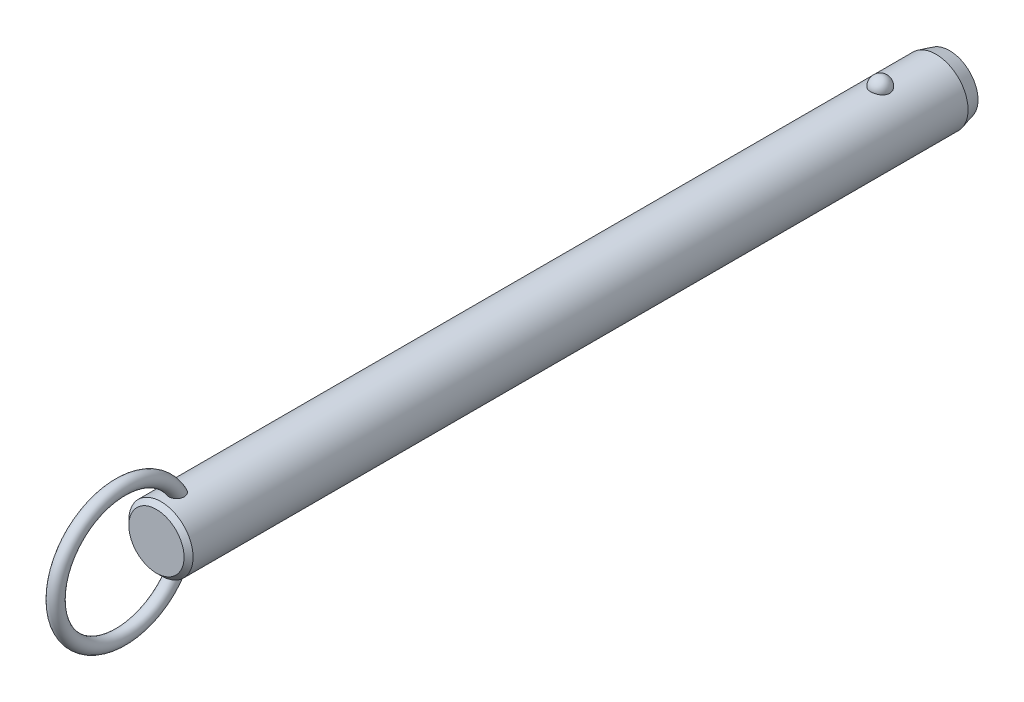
ISO-10303-21;
HEADER;
FILE_DESCRIPTION(('STEP AP214'),'2;1');
FILE_NAME('part.step','',(''),(''),'','','');
FILE_SCHEMA(('AUTOMOTIVE_DESIGN { 1 0 10303 214 1 1 1 1 }'));
ENDSEC;
DATA;
#1=APPLICATION_CONTEXT('core data for automotive mechanical design processes');
#2=APPLICATION_PROTOCOL_DEFINITION('international standard','automotive_design',2000,#1);
#3=PRODUCT_CONTEXT('',#1,'mechanical');
#4=PRODUCT('Part','Part','',(#3));
#5=PRODUCT_RELATED_PRODUCT_CATEGORY('part','',(#4));
#6=PRODUCT_DEFINITION_FORMATION('','',#4);
#7=PRODUCT_DEFINITION_CONTEXT('part definition',#1,'design');
#8=PRODUCT_DEFINITION('design','',#6,#7);
#9=PRODUCT_DEFINITION_SHAPE('','',#8);
#10=(LENGTH_UNIT() NAMED_UNIT(*) SI_UNIT(.MILLI.,.METRE.));
#11=(NAMED_UNIT(*) PLANE_ANGLE_UNIT() SI_UNIT($,.RADIAN.));
#12=(NAMED_UNIT(*) SI_UNIT($,.STERADIAN.) SOLID_ANGLE_UNIT());
#13=UNCERTAINTY_MEASURE_WITH_UNIT(LENGTH_MEASURE(1.E-05),#10,'distance_accuracy_value','');
#14=(GEOMETRIC_REPRESENTATION_CONTEXT(3) GLOBAL_UNCERTAINTY_ASSIGNED_CONTEXT((#13)) GLOBAL_UNIT_ASSIGNED_CONTEXT((#10,
#11,#12)) REPRESENTATION_CONTEXT('',''));
#15=CARTESIAN_POINT('',(0.,0.,0.));
#16=DIRECTION('',(0.,0.,1.));
#17=DIRECTION('',(1.,0.,0.));
#18=AXIS2_PLACEMENT_3D('',#15,#16,#17);
#19=CARTESIAN_POINT('',(0.,0.,149.9));
#20=DIRECTION('',(0.,0.,-1.));
#21=DIRECTION('',(-1.,0.,0.));
#22=AXIS2_PLACEMENT_3D('',#19,#20,#21);
#23=CYLINDRICAL_SURFACE('',#22,7.1);
#24=CARTESIAN_POINT('',(2.0769088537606,6.78943661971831,-2.1));
#25=CARTESIAN_POINT('',(2.07690739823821,6.78943796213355,-1.98268154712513));
#26=CARTESIAN_POINT('',(2.06738130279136,6.79237331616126,-1.86534506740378));
#27=CARTESIAN_POINT('',(2.0295040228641,6.8037853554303,-1.63400788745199));
#28=CARTESIAN_POINT('',(2.00114757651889,6.81226358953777,-1.52000812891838));
#29=CARTESIAN_POINT('',(1.92632025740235,6.83379798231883,-1.29863433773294));
#30=CARTESIAN_POINT('',(1.87985726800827,6.84685214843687,-1.19125744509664));
#31=CARTESIAN_POINT('',(1.76995205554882,6.87608091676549,-0.98604657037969));
#32=CARTESIAN_POINT('',(1.70650980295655,6.8922555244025,-0.88821260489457));
#33=CARTESIAN_POINT('',(1.5638119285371,6.92602930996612,-0.704242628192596));
#34=CARTESIAN_POINT('',(1.4844714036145,6.94363582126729,-0.618173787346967));
#35=CARTESIAN_POINT('',(1.31221746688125,6.97823658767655,-0.460740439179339));
#36=CARTESIAN_POINT('',(1.21930409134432,6.99523084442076,-0.389375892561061));
#37=CARTESIAN_POINT('',(1.02268781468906,7.02666176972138,-0.263547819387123));
#38=CARTESIAN_POINT('',(0.91902009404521,7.04110638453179,-0.209031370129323));
#39=CARTESIAN_POINT('',(0.703548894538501,7.06588726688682,-0.118163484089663));
#40=CARTESIAN_POINT('',(0.591746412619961,7.07622403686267,-0.0818098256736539));
#41=CARTESIAN_POINT('',(0.365557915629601,7.09147068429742,-0.0288711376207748));
#42=CARTESIAN_POINT('',(0.251267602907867,7.09648447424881,-0.0119070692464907));
#43=CARTESIAN_POINT('',(0.0213499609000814,7.10089837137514,0.00304925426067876));
#44=CARTESIAN_POINT('',(-0.0942772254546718,7.10029907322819,0.00104351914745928));
#45=CARTESIAN_POINT('',(-0.321651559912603,7.09360829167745,-0.0216931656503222));
#46=CARTESIAN_POINT('',(-0.433431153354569,7.08760388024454,-0.0421272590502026));
#47=CARTESIAN_POINT('',(-0.651862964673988,7.07086131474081,-0.100729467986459));
#48=CARTESIAN_POINT('',(-0.758515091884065,7.06012307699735,-0.138897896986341));
#49=CARTESIAN_POINT('',(-0.964449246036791,7.03496097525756,-0.232213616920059));
#50=CARTESIAN_POINT('',(-1.06368095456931,7.02051445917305,-0.287465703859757));
#51=CARTESIAN_POINT('',(-1.25145353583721,6.98948740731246,-0.413383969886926));
#52=CARTESIAN_POINT('',(-1.33999321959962,6.97290663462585,-0.48405186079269));
#53=CARTESIAN_POINT('',(-1.50591604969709,6.93898770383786,-0.640594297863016));
#54=CARTESIAN_POINT('',(-1.58302488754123,6.92164094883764,-0.726757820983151));
#55=CARTESIAN_POINT('',(-1.72189320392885,6.8884103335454,-0.91092752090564));
#56=CARTESIAN_POINT('',(-1.78365144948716,6.87252659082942,-1.008934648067));
#57=CARTESIAN_POINT('',(-1.89101272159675,6.84377189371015,-1.21549497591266));
#58=CARTESIAN_POINT('',(-1.93639553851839,6.83094274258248,-1.32416860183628));
#59=CARTESIAN_POINT('',(-2.00874275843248,6.81002070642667,-1.54791500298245));
#60=CARTESIAN_POINT('',(-2.03570774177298,6.80192767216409,-1.66298757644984));
#61=CARTESIAN_POINT('',(-2.07047276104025,6.7914266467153,-1.89571453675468));
#62=CARTESIAN_POINT('',(-2.07835878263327,6.78899315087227,-2.01335491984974));
#63=CARTESIAN_POINT('',(-2.07502083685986,6.79001409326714,-2.24833570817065));
#64=CARTESIAN_POINT('',(-2.06379746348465,6.7934683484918,-2.36567612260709));
#65=CARTESIAN_POINT('',(-2.02263913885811,6.80583442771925,-2.59603194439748));
#66=CARTESIAN_POINT('',(-1.99281127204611,6.81471501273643,-2.70906820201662));
#67=CARTESIAN_POINT('',(-1.91526639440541,6.83691232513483,-2.92836575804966));
#68=CARTESIAN_POINT('',(-1.8675486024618,6.85022924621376,-3.03462676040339));
#69=CARTESIAN_POINT('',(-1.75504492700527,6.87991336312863,-3.23806487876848));
#70=CARTESIAN_POINT('',(-1.69015924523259,6.89629822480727,-3.33518422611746));
#71=CARTESIAN_POINT('',(-1.54505404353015,6.93024852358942,-3.51697105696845));
#72=CARTESIAN_POINT('',(-1.46483385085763,6.94781401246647,-3.60163799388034));
#73=CARTESIAN_POINT('',(-1.29071406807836,6.98225977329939,-3.75654119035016));
#74=CARTESIAN_POINT('',(-1.19675650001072,6.99913673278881,-3.82671308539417));
#75=CARTESIAN_POINT('',(-0.997940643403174,7.03023618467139,-3.9501837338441));
#76=CARTESIAN_POINT('',(-0.89308318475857,7.04445887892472,-4.00348377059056));
#77=CARTESIAN_POINT('',(-0.676902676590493,7.06848365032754,-4.09107242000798));
#78=CARTESIAN_POINT('',(-0.565686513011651,7.0783430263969,-4.12560889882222));
#79=CARTESIAN_POINT('',(-0.338739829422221,7.09282534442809,-4.17575450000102));
#80=CARTESIAN_POINT('',(-0.223009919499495,7.09744899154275,-4.19136617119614));
#81=CARTESIAN_POINT('',(0.00707628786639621,7.10090930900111,-4.20307965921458));
#82=CARTESIAN_POINT('',(0.121410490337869,7.09986531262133,-4.19958377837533));
#83=CARTESIAN_POINT('',(0.347815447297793,7.092380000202,-4.17411564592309));
#84=CARTESIAN_POINT('',(0.459886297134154,7.08593891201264,-4.15214417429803));
#85=CARTESIAN_POINT('',(0.678084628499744,7.06838983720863,-4.09049562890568));
#86=CARTESIAN_POINT('',(0.784237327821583,7.05730369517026,-4.05090137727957));
#87=CARTESIAN_POINT('',(0.988305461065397,7.03163139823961,-3.95511447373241));
#88=CARTESIAN_POINT('',(1.08622031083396,7.01704499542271,-3.89892064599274));
#89=CARTESIAN_POINT('',(1.27284490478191,6.98562668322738,-3.77035541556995));
#90=CARTESIAN_POINT('',(1.36137372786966,6.96876135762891,-3.69772964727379));
#91=CARTESIAN_POINT('',(1.52509486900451,6.93477412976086,-3.53878279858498));
#92=CARTESIAN_POINT('',(1.60028496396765,6.91765218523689,-3.45245943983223));
#93=CARTESIAN_POINT('',(1.73681688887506,6.88465753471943,-3.26658774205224));
#94=CARTESIAN_POINT('',(1.79785966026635,6.86881574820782,-3.16681408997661));
#95=CARTESIAN_POINT('',(1.90265327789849,6.84053157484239,-2.95814408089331));
#96=CARTESIAN_POINT('',(1.94640861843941,6.82808830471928,-2.84925010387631));
#97=CARTESIAN_POINT('',(2.01274378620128,6.80881460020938,-2.63454318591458));
#98=CARTESIAN_POINT('',(2.03676193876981,6.80160856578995,-2.52920574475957));
#99=CARTESIAN_POINT('',(2.06884490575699,6.79191902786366,-2.3159172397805));
#100=CARTESIAN_POINT('',(2.07691019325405,6.78943538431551,-2.20796625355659));
#101=CARTESIAN_POINT('',(2.0769088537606,6.78943661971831,-2.1));
#102=B_SPLINE_CURVE_WITH_KNOTS('',3,(#24,#25,#26,#27,#28,#29,#30,#31,#32,#33,#34,#35,#36,#37,
#38,#39,#40,#41,#42,#43,#44,#45,#46,#47,#48,#49,#50,#51,#52,#53,#54,#55,#56,#57,#58,#59,#60,#61,
#62,#63,#64,#65,#66,#67,#68,#69,#70,#71,#72,#73,#74,#75,#76,#77,#78,#79,#80,#81,#82,#83,#84,#85,
#86,#87,#88,#89,#90,#91,#92,#93,#94,#95,#96,#97,#98,#99,#100,#101),.UNSPECIFIED.,.T.,.F.,(4,2,2,
2,2,2,2,2,2,2,2,2,2,2,2,2,2,2,2,2,2,2,2,2,2,2,2,2,2,2,2,2,2,2,2,2,2,2,4),(0.,0.351568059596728,
0.703234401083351,1.05474780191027,1.40626181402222,1.75970563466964,2.11314851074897,
2.4654696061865,2.81774759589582,3.16301449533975,3.50824481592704,3.84801136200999,
4.18778391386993,4.52968352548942,4.87162112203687,5.22076181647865,5.56993054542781,
5.92363364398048,6.27732559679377,6.62942052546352,6.98150450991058,7.33158042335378,
7.68167162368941,8.03384443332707,8.38603269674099,8.73975272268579,9.09344583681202,
9.44234545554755,9.79119807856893,10.1327344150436,10.4742563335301,10.8141898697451,
11.1541474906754,11.4997793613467,11.8454687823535,12.1979079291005,12.5502553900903,
12.8738073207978,13.1973496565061),.UNSPECIFIED.);
#103=CARTESIAN_POINT('',(2.0769088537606,6.78943661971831,-2.1));
#104=VERTEX_POINT('',#103);
#105=EDGE_CURVE('E41',#104,#104,#102,.T.);
#106=ORIENTED_EDGE('',*,*,#105,.T.);
#107=EDGE_LOOP('',(#106));
#108=FACE_BOUND('',#107,.T.);
#109=CARTESIAN_POINT('',(0.,0.,156.82));
#110=DIRECTION('',(0.,0.,1.));
#111=DIRECTION('',(1.,0.,0.));
#112=AXIS2_PLACEMENT_3D('',#109,#110,#111);
#113=CIRCLE('',#112,7.1);
#114=CARTESIAN_POINT('',(7.1,0.,156.82));
#115=VERTEX_POINT('',#114);
#116=EDGE_CURVE('E10',#115,#115,#113,.F.);
#117=ORIENTED_EDGE('',*,*,#116,.T.);
#118=EDGE_LOOP('',(#117));
#119=FACE_BOUND('',#118,.T.);
#120=CARTESIAN_POINT('',(-0.429539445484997,-7.08699541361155,151.642921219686));
#121=CARTESIAN_POINT('',(-0.508331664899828,-7.08221999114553,151.666876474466));
#122=CARTESIAN_POINT('',(-0.585039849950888,-7.07624016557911,151.697457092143));
#123=CARTESIAN_POINT('',(-0.73208265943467,-7.06254296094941,151.771024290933));
#124=CARTESIAN_POINT('',(-0.802417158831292,-7.05482554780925,151.814011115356));
#125=CARTESIAN_POINT('',(-0.934722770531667,-7.03851844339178,151.911113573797));
#126=CARTESIAN_POINT('',(-0.996700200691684,-7.02992941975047,151.965220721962));
#127=CARTESIAN_POINT('',(-1.11079942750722,-7.01280697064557,152.082967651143));
#128=CARTESIAN_POINT('',(-1.16292136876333,-7.00427354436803,152.146607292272));
#129=CARTESIAN_POINT('',(-1.25705660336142,-6.98799959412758,152.282687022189));
#130=CARTESIAN_POINT('',(-1.29888032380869,-6.98027525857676,152.355259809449));
#131=CARTESIAN_POINT('',(-1.37069920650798,-6.96652886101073,152.506168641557));
#132=CARTESIAN_POINT('',(-1.40069157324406,-6.96050720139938,152.584506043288));
#133=CARTESIAN_POINT('',(-1.45043507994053,-6.95031881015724,152.750190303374));
#134=CARTESIAN_POINT('',(-1.46937115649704,-6.94630231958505,152.837789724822));
#135=CARTESIAN_POINT('',(-1.49424917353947,-6.94099239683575,153.014871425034));
#136=CARTESIAN_POINT('',(-1.50018601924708,-6.93970003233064,153.104354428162));
#137=CARTESIAN_POINT('',(-1.49978214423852,-6.93978815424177,153.294060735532));
#138=CARTESIAN_POINT('',(-1.49187639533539,-6.94150934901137,153.394279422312));
#139=CARTESIAN_POINT('',(-1.46177925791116,-6.94790814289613,153.592479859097));
#140=CARTESIAN_POINT('',(-1.43957541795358,-6.95258831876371,153.690459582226));
#141=CARTESIAN_POINT('',(-1.37783293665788,-6.96510647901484,153.89536292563));
#142=CARTESIAN_POINT('',(-1.33634073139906,-6.97328848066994,154.001680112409));
#143=CARTESIAN_POINT('',(-1.23686994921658,-6.99161706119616,154.206177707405));
#144=CARTESIAN_POINT('',(-1.17889192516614,-7.00176357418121,154.304358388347));
#145=CARTESIAN_POINT('',(-1.05875124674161,-7.02082898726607,154.472374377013));
#146=CARTESIAN_POINT('',(-0.999247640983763,-7.02963746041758,154.544123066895));
#147=CARTESIAN_POINT('',(-0.869494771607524,-7.04686074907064,154.677195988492));
#148=CARTESIAN_POINT('',(-0.799263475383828,-7.05527619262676,154.738537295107));
#149=CARTESIAN_POINT('',(-0.665408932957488,-7.06899457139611,154.835131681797));
#150=CARTESIAN_POINT('',(-0.603817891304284,-7.07457275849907,154.873151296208));
#151=CARTESIAN_POINT('',(-0.475172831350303,-7.08437420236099,154.938758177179));
#152=CARTESIAN_POINT('',(-0.408123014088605,-7.08859848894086,154.966353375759));
#153=CARTESIAN_POINT('',(-0.269431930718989,-7.09522749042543,155.009256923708));
#154=CARTESIAN_POINT('',(-0.197757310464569,-7.09761688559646,155.024461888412));
#155=CARTESIAN_POINT('',(-0.0527849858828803,-7.10017268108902,155.040716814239));
#156=CARTESIAN_POINT('',(0.0205115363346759,-7.10034065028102,155.041776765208));
#157=CARTESIAN_POINT('',(0.156426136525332,-7.09855986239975,155.030461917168));
#158=CARTESIAN_POINT('',(0.219199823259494,-7.09688191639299,155.019806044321));
#159=CARTESIAN_POINT('',(0.342134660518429,-7.09201880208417,154.988537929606));
#160=CARTESIAN_POINT('',(0.402295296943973,-7.08883333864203,154.967923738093));
#161=CARTESIAN_POINT('',(0.520687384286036,-7.08113868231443,154.917212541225));
#162=CARTESIAN_POINT('',(0.578791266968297,-7.07658958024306,154.886827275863));
#163=CARTESIAN_POINT('',(0.690173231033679,-7.06659708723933,154.818367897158));
#164=CARTESIAN_POINT('',(0.743447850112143,-7.061153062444,154.780288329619));
#165=CARTESIAN_POINT('',(0.870947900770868,-7.04680292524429,154.676592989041));
#166=CARTESIAN_POINT('',(0.941828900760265,-7.03755800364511,154.606897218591));
#167=CARTESIAN_POINT('',(1.07136606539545,-7.01900793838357,154.456945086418));
#168=CARTESIAN_POINT('',(1.13000013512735,-7.00970271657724,154.376670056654));
#169=CARTESIAN_POINT('',(1.23579584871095,-6.99183327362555,154.206899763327));
#170=CARTESIAN_POINT('',(1.28274271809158,-6.98328455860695,154.117269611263));
#171=CARTESIAN_POINT('',(1.36351442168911,-6.96796352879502,153.932176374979));
#172=CARTESIAN_POINT('',(1.39733971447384,-6.96119115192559,153.836713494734));
#173=CARTESIAN_POINT('',(1.45579181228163,-6.94922464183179,153.62530928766));
#174=CARTESIAN_POINT('',(1.47790145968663,-6.94449000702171,153.508631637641));
#175=CARTESIAN_POINT('',(1.50168752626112,-6.93938731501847,153.273015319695));
#176=CARTESIAN_POINT('',(1.50336085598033,-6.93901991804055,153.15407631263));
#177=CARTESIAN_POINT('',(1.48486516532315,-6.9430010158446,152.92360799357));
#178=CARTESIAN_POINT('',(1.46573441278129,-6.9471253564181,152.811995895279));
#179=CARTESIAN_POINT('',(1.40606892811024,-6.95944667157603,152.594886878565));
#180=CARTESIAN_POINT('',(1.36556446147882,-6.96763788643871,152.4893815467));
#181=CARTESIAN_POINT('',(1.2708270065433,-6.98548038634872,152.304287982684));
#182=CARTESIAN_POINT('',(1.21949810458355,-6.99473841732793,152.223171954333));
#183=CARTESIAN_POINT('',(1.10242050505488,-7.01414069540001,152.072227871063));
#184=CARTESIAN_POINT('',(1.03668119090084,-7.02428436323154,152.00239252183));
#185=CARTESIAN_POINT('',(0.900559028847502,-7.04295285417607,151.883573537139));
#186=CARTESIAN_POINT('',(0.831428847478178,-7.05153466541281,151.833157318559));
#187=CARTESIAN_POINT('',(0.685291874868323,-7.06723150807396,151.745142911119));
#188=CARTESIAN_POINT('',(0.608287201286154,-7.07434693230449,151.707541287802));
#189=CARTESIAN_POINT('',(0.451878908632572,-7.08602232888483,151.647491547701));
#190=CARTESIAN_POINT('',(0.372686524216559,-7.09067127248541,151.624508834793));
#191=CARTESIAN_POINT('',(0.21147739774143,-7.09730788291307,151.592035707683));
#192=CARTESIAN_POINT('',(0.129460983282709,-7.09929585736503,151.58254373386));
#193=CARTESIAN_POINT('',(-0.0332905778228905,-7.10037858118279,151.577351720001));
#194=CARTESIAN_POINT('',(-0.114016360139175,-7.09953334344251,151.581365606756));
#195=CARTESIAN_POINT('',(-0.273670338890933,-7.09517338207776,151.602454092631));
#196=CARTESIAN_POINT('',(-0.352598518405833,-7.09165863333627,151.619528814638));
#197=CARTESIAN_POINT('',(-0.429539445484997,-7.08699541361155,151.642921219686));
#198=B_SPLINE_CURVE_WITH_KNOTS('',3,(#120,#121,#122,#123,#124,#125,#126,#127,#128,#129,#130,
#131,#132,#133,#134,#135,#136,#137,#138,#139,#140,#141,#142,#143,#144,#145,#146,#147,#148,#149,
#150,#151,#152,#153,#154,#155,#156,#157,#158,#159,#160,#161,#162,#163,#164,#165,#166,#167,#168,
#169,#170,#171,#172,#173,#174,#175,#176,#177,#178,#179,#180,#181,#182,#183,#184,#185,#186,#187,
#188,#189,#190,#191,#192,#193,#194,#195,#196,#197),.UNSPECIFIED.,.T.,.F.,(4,2,2,2,2,2,2,2,2,2,2,
2,2,2,2,2,2,2,2,2,2,2,2,2,2,2,2,2,2,2,2,2,2,2,2,2,2,2,4),(0.,0.247183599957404,
0.494372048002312,0.741372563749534,0.988369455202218,1.23962059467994,1.490931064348,
1.75897818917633,2.02713035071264,2.32758265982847,2.62829697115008,2.97008736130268,
3.31186629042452,3.59175319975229,3.87117637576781,4.08813841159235,4.30493502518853,
4.5235225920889,4.74195577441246,4.93215328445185,5.12238804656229,5.31884850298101,
5.51544871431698,5.81332317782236,6.11173048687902,6.41527266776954,6.71880423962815,
7.07358156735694,7.42841252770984,7.76631485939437,8.10373999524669,8.39142246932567,
8.67891817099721,8.93560332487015,9.19221962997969,9.43881106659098,9.68537399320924,
9.92674752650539,10.1681233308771),.UNSPECIFIED.);
#199=CARTESIAN_POINT('',(-0.429539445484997,-7.08699541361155,151.642921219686));
#200=VERTEX_POINT('',#199);
#201=EDGE_CURVE('E60',#200,#200,#198,.T.);
#202=ORIENTED_EDGE('',*,*,#201,.T.);
#203=EDGE_LOOP('',(#202));
#204=FACE_BOUND('',#203,.T.);
#205=CARTESIAN_POINT('',(-0.429539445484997,7.08699541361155,151.642921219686));
#206=CARTESIAN_POINT('',(-0.35166550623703,7.09171429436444,151.619246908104));
#207=CARTESIAN_POINT('',(-0.271733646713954,7.09525896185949,151.602036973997));
#208=CARTESIAN_POINT('',(-0.110026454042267,7.09960839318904,151.581005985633));
#209=CARTESIAN_POINT('',(-0.0282502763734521,7.10041187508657,151.577191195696));
#210=CARTESIAN_POINT('',(0.134782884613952,7.09918849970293,151.583059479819));
#211=CARTESIAN_POINT('',(0.216039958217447,7.09716214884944,151.59274013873));
#212=CARTESIAN_POINT('',(0.375730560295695,7.09050177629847,151.625347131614));
#213=CARTESIAN_POINT('',(0.454164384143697,7.08586802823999,151.648272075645));
#214=CARTESIAN_POINT('',(0.606025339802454,7.07449911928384,151.706771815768));
#215=CARTESIAN_POINT('',(0.67945100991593,7.06776334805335,151.742350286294));
#216=CARTESIAN_POINT('',(0.819234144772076,7.05292866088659,151.825175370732));
#217=CARTESIAN_POINT('',(0.88559181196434,7.04482978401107,151.872421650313));
#218=CARTESIAN_POINT('',(1.00993211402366,7.02808709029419,151.977590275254));
#219=CARTESIAN_POINT('',(1.06785399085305,7.01943990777,152.035583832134));
#220=CARTESIAN_POINT('',(1.17342527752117,7.00256662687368,152.160301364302));
#221=CARTESIAN_POINT('',(1.22107408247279,6.99434055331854,152.227025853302));
#222=CARTESIAN_POINT('',(1.30652927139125,6.97889183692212,152.369362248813));
#223=CARTESIAN_POINT('',(1.34399711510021,6.97170674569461,152.445180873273));
#224=CARTESIAN_POINT('',(1.40682616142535,6.95930080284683,152.601810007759));
#225=CARTESIAN_POINT('',(1.43218374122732,6.95408053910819,152.68262200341));
#226=CARTESIAN_POINT('',(1.47246409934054,6.94566853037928,152.853531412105));
#227=CARTESIAN_POINT('',(1.48642590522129,6.9426653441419,152.94386307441));
#228=CARTESIAN_POINT('',(1.5011410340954,6.93949744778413,153.125619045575));
#229=CARTESIAN_POINT('',(1.50188917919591,6.93933385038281,153.217043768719));
#230=CARTESIAN_POINT('',(1.49030464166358,6.94183245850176,153.41084381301));
#231=CARTESIAN_POINT('',(1.47627413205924,6.94486147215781,153.513112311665));
#232=CARTESIAN_POINT('',(1.43356351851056,6.95380194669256,153.714471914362));
#233=CARTESIAN_POINT('',(1.4048676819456,6.95971650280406,153.813559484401));
#234=CARTESIAN_POINT('',(1.32908750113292,6.97461208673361,154.018908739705));
#235=CARTESIAN_POINT('',(1.28011435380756,6.98388945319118,154.124456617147));
#236=CARTESIAN_POINT('',(1.16520357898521,7.00397743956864,154.325760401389));
#237=CARTESIAN_POINT('',(1.09927694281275,7.01478706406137,154.421522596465));
#238=CARTESIAN_POINT('',(0.969361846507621,7.03373936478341,154.576756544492));
#239=CARTESIAN_POINT('',(0.909042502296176,7.04187023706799,154.639303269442));
#240=CARTESIAN_POINT('',(0.779178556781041,7.05741732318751,154.754053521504));
#241=CARTESIAN_POINT('',(0.709649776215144,7.06483472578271,154.806274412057));
#242=CARTESIAN_POINT('',(0.576854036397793,7.0767751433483,154.888113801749));
#243=CARTESIAN_POINT('',(0.515118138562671,7.08158033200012,154.920164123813));
#244=CARTESIAN_POINT('',(0.387127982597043,7.08972701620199,154.973765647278));
#245=CARTESIAN_POINT('',(0.320877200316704,7.09306962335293,154.995324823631));
#246=CARTESIAN_POINT('',(0.185041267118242,7.09791507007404,155.026400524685));
#247=CARTESIAN_POINT('',(0.115437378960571,7.09940591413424,155.035838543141));
#248=CARTESIAN_POINT('',(-0.0243157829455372,7.10030171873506,155.041522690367));
#249=CARTESIAN_POINT('',(-0.0944648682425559,7.0997073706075,155.037773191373));
#250=CARTESIAN_POINT('',(-0.225713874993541,7.09668414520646,155.018508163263));
#251=CARTESIAN_POINT('',(-0.287006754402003,7.09444865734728,155.004232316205));
#252=CARTESIAN_POINT('',(-0.406555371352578,7.08860360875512,154.966368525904));
#253=CARTESIAN_POINT('',(-0.464809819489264,7.08499346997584,154.942776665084));
#254=CARTESIAN_POINT('',(-0.594955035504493,7.07541654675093,154.878923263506));
#255=CARTESIAN_POINT('',(-0.665389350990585,7.06906574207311,154.835753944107));
#256=CARTESIAN_POINT('',(-0.798242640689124,7.05530261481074,154.738587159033));
#257=CARTESIAN_POINT('',(-0.860645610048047,7.0478882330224,154.684568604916));
#258=CARTESIAN_POINT('',(-0.994249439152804,7.03045217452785,154.550996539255));
#259=CARTESIAN_POINT('',(-1.06260129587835,7.02030745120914,154.468614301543));
#260=CARTESIAN_POINT('',(-1.18502045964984,7.00068382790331,154.293843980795));
#261=CARTESIAN_POINT('',(-1.23907684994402,6.99120544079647,154.201448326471));
#262=CARTESIAN_POINT('',(-1.33335589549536,6.97384343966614,154.008008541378));
#263=CARTESIAN_POINT('',(-1.37336138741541,6.96598557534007,153.906856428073));
#264=CARTESIAN_POINT('',(-1.43770677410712,6.9529905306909,153.699504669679));
#265=CARTESIAN_POINT('',(-1.46204473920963,6.94785368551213,153.59330440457));
#266=CARTESIAN_POINT('',(-1.49537533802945,6.94076296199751,153.368231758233));
#267=CARTESIAN_POINT('',(-1.50273564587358,6.93914842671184,153.24909751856));
#268=CARTESIAN_POINT('',(-1.4954555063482,6.94072368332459,153.011470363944));
#269=CARTESIAN_POINT('',(-1.48082914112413,6.94391040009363,152.892977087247));
#270=CARTESIAN_POINT('',(-1.43076401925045,6.95438579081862,152.673432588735));
#271=CARTESIAN_POINT('',(-1.39762227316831,6.96121852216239,152.571841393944));
#272=CARTESIAN_POINT('',(-1.31211274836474,6.97783941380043,152.377351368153));
#273=CARTESIAN_POINT('',(-1.25976607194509,6.98762432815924,152.28444313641));
#274=CARTESIAN_POINT('',(-1.14583073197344,7.00713153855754,152.124160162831));
#275=CARTESIAN_POINT('',(-1.08665947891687,7.01665982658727,152.055035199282));
#276=CARTESIAN_POINT('',(-0.95660664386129,7.03556646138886,151.928878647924));
#277=CARTESIAN_POINT('',(-0.885737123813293,7.04494495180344,151.871834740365));
#278=CARTESIAN_POINT('',(-0.7515580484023,7.06035735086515,151.783100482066));
#279=CARTESIAN_POINT('',(-0.690120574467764,7.0666695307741,151.748593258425));
#280=CARTESIAN_POINT('',(-0.562815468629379,7.07794609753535,151.688750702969));
#281=CARTESIAN_POINT('',(-0.496948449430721,7.08291067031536,151.663414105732));
#282=CARTESIAN_POINT('',(-0.429539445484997,7.08699541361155,151.642921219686));
#283=B_SPLINE_CURVE_WITH_KNOTS('',3,(#205,#206,#207,#208,#209,#210,#211,#212,#213,#214,#215,
#216,#217,#218,#219,#220,#221,#222,#223,#224,#225,#226,#227,#228,#229,#230,#231,#232,#233,#234,
#235,#236,#237,#238,#239,#240,#241,#242,#243,#244,#245,#246,#247,#248,#249,#250,#251,#252,#253,
#254,#255,#256,#257,#258,#259,#260,#261,#262,#263,#264,#265,#266,#267,#268,#269,#270,#271,#272,
#273,#274,#275,#276,#277,#278,#279,#280,#281,#282),.UNSPECIFIED.,.T.,.F.,(4,2,2,2,2,2,2,2,2,2,2,
2,2,2,2,2,2,2,2,2,2,2,2,2,2,2,2,2,2,2,2,2,2,2,2,2,2,2,4),(0.,0.244335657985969,
0.488785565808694,0.733191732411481,0.977572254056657,1.2220237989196,1.46646834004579,
1.71259457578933,1.9587352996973,2.21226768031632,2.46587585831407,2.73913816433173,
3.01250754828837,3.32109936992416,3.63002293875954,3.9786351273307,4.32702187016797,
4.58793945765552,4.84841449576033,5.05676704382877,5.26496096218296,5.47449661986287,
5.68396281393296,5.87205447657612,6.06022532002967,6.30743751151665,6.55513496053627,
6.87602468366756,7.1971587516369,7.52305774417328,7.84899686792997,8.2051615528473,
8.56109821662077,8.88040084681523,9.19935367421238,9.47236282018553,9.74509220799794,
9.9566225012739,10.1681235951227),.UNSPECIFIED.);
#284=CARTESIAN_POINT('',(-0.429539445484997,7.08699541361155,151.642921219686));
#285=VERTEX_POINT('',#284);
#286=EDGE_CURVE('E67',#285,#285,#283,.T.);
#287=ORIENTED_EDGE('',*,*,#286,.T.);
#288=EDGE_LOOP('',(#287));
#289=FACE_BOUND('',#288,.T.);
#290=CARTESIAN_POINT('',(0.,0.,-14.3999999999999));
#291=DIRECTION('',(0.,0.,-1.));
#292=DIRECTION('',(-1.,0.,0.));
#293=AXIS2_PLACEMENT_3D('',#290,#291,#292);
#294=CIRCLE('',#293,7.1);
#295=CARTESIAN_POINT('',(7.1,0.,-14.3999999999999));
#296=VERTEX_POINT('',#295);
#297=EDGE_CURVE('E57',#296,#296,#294,.F.);
#298=ORIENTED_EDGE('',*,*,#297,.T.);
#299=EDGE_LOOP('',(#298));
#300=FACE_BOUND('',#299,.T.);
#301=ADVANCED_FACE('F37',(#108,#119,#204,#289,#300),#23,.T.);
#302=CARTESIAN_POINT('',(0.,0.,-17.4));
#303=DIRECTION('',(0.,0.,-1.));
#304=DIRECTION('',(-1.,0.,0.));
#305=AXIS2_PLACEMENT_3D('',#302,#303,#304);
#306=PLANE('',#305);
#307=CARTESIAN_POINT('',(0.,0.,-17.4));
#308=DIRECTION('',(0.,0.,-1.));
#309=DIRECTION('',(-1.,0.,0.));
#310=AXIS2_PLACEMENT_3D('',#307,#308,#309);
#311=CIRCLE('',#310,6.29615242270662);
#312=CARTESIAN_POINT('',(6.29615242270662,0.,-17.4));
#313=VERTEX_POINT('',#312);
#314=EDGE_CURVE('E66',#313,#313,#311,.T.);
#315=ORIENTED_EDGE('',*,*,#314,.T.);
#316=EDGE_LOOP('',(#315));
#317=FACE_BOUND('',#316,.T.);
#318=ADVANCED_FACE('F85',(#317),#306,.T.);
#319=CARTESIAN_POINT('',(0.,0.,-17.4));
#320=DIRECTION('',(0.,0.,1.));
#321=DIRECTION('',(1.,0.,0.));
#322=AXIS2_PLACEMENT_3D('',#319,#320,#321);
#323=CONICAL_SURFACE('',#322,6.29615242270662,0.261799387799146);
#324=CARTESIAN_POINT('',(7.1,0.,-14.3999999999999));
#325=CARTESIAN_POINT('',(7.09162658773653,0.,-14.4312499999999));
#326=CARTESIAN_POINT('',(7.08325317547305,0.,-14.4624999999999));
#327=CARTESIAN_POINT('',(7.06650635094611,0.,-14.5249999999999));
#328=CARTESIAN_POINT('',(7.05813293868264,0.,-14.5562499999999));
#329=CARTESIAN_POINT('',(7.04138611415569,0.,-14.6187499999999));
#330=CARTESIAN_POINT('',(7.03301270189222,0.,-14.6499999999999));
#331=CARTESIAN_POINT('',(7.01626587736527,0.,-14.7124999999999));
#332=CARTESIAN_POINT('',(7.0078924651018,0.,-14.7437499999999));
#333=CARTESIAN_POINT('',(6.99114564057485,0.,-14.8062499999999));
#334=CARTESIAN_POINT('',(6.98277222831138,0.,-14.8374999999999));
#335=CARTESIAN_POINT('',(6.96602540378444,0.,-14.8999999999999));
#336=CARTESIAN_POINT('',(6.95765199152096,0.,-14.9312499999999));
#337=CARTESIAN_POINT('',(6.94090516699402,0.,-14.9937499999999));
#338=CARTESIAN_POINT('',(6.93253175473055,0.,-15.0249999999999));
#339=CARTESIAN_POINT('',(6.9157849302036,0.,-15.0874999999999));
#340=CARTESIAN_POINT('',(6.90741151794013,0.,-15.1187499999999));
#341=CARTESIAN_POINT('',(6.89066469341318,0.,-15.1812499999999));
#342=CARTESIAN_POINT('',(6.88229128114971,0.,-15.2124999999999));
#343=CARTESIAN_POINT('',(6.86554445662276,0.,-15.2749999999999));
#344=CARTESIAN_POINT('',(6.85717104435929,0.,-15.3062499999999));
#345=CARTESIAN_POINT('',(6.84042421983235,0.,-15.3687499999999));
#346=CARTESIAN_POINT('',(6.83205080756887,0.,-15.3999999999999));
#347=CARTESIAN_POINT('',(6.81530398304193,0.,-15.4624999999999));
#348=CARTESIAN_POINT('',(6.80693057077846,0.,-15.4937499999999));
#349=CARTESIAN_POINT('',(6.79018374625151,0.,-15.5562499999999));
#350=CARTESIAN_POINT('',(6.78181033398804,0.,-15.5874999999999));
#351=CARTESIAN_POINT('',(6.76506350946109,0.,-15.6499999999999));
#352=CARTESIAN_POINT('',(6.75669009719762,0.,-15.6812499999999));
#353=CARTESIAN_POINT('',(6.73994327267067,0.,-15.7437499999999));
#354=CARTESIAN_POINT('',(6.7315698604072,0.,-15.775));
#355=CARTESIAN_POINT('',(6.71482303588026,0.,-15.8375));
#356=CARTESIAN_POINT('',(6.70644962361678,0.,-15.86875));
#357=CARTESIAN_POINT('',(6.68970279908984,0.,-15.93125));
#358=CARTESIAN_POINT('',(6.68132938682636,0.,-15.9625));
#359=CARTESIAN_POINT('',(6.66458256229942,0.,-16.025));
#360=CARTESIAN_POINT('',(6.65620915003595,0.,-16.05625));
#361=CARTESIAN_POINT('',(6.639462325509,0.,-16.11875));
#362=CARTESIAN_POINT('',(6.63108891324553,0.,-16.15));
#363=CARTESIAN_POINT('',(6.61434208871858,0.,-16.2125));
#364=CARTESIAN_POINT('',(6.60596867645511,0.,-16.24375));
#365=CARTESIAN_POINT('',(6.58922185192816,0.,-16.30625));
#366=CARTESIAN_POINT('',(6.58084843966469,0.,-16.3375));
#367=CARTESIAN_POINT('',(6.56410161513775,0.,-16.4));
#368=CARTESIAN_POINT('',(6.55572820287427,0.,-16.43125));
#369=CARTESIAN_POINT('',(6.53898137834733,0.,-16.49375));
#370=CARTESIAN_POINT('',(6.53060796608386,0.,-16.525));
#371=CARTESIAN_POINT('',(6.51386114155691,0.,-16.5875));
#372=CARTESIAN_POINT('',(6.50548772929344,0.,-16.61875));
#373=CARTESIAN_POINT('',(6.48874090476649,0.,-16.68125));
#374=CARTESIAN_POINT('',(6.48036749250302,0.,-16.7125));
#375=CARTESIAN_POINT('',(6.46362066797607,0.,-16.775));
#376=CARTESIAN_POINT('',(6.4552472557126,0.,-16.80625));
#377=CARTESIAN_POINT('',(6.43850043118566,0.,-16.86875));
#378=CARTESIAN_POINT('',(6.43012701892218,0.,-16.9));
#379=CARTESIAN_POINT('',(6.41338019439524,0.,-16.9625));
#380=CARTESIAN_POINT('',(6.40500678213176,0.,-16.99375));
#381=CARTESIAN_POINT('',(6.38825995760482,0.,-17.05625));
#382=CARTESIAN_POINT('',(6.37988654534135,0.,-17.0875));
#383=CARTESIAN_POINT('',(6.3631397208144,0.,-17.15));
#384=CARTESIAN_POINT('',(6.35476630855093,0.,-17.18125));
#385=CARTESIAN_POINT('',(6.33801948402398,0.,-17.24375));
#386=CARTESIAN_POINT('',(6.32964607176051,0.,-17.275));
#387=CARTESIAN_POINT('',(6.31289924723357,0.,-17.3375));
#388=CARTESIAN_POINT('',(6.30452583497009,0.,-17.36875));
#389=CARTESIAN_POINT('',(6.29615242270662,0.,-17.4));
#390=B_SPLINE_CURVE_WITH_KNOTS('',3,(#324,#325,#326,#327,#328,#329,#330,#331,#332,#333,#334,
#335,#336,#337,#338,#339,#340,#341,#342,#343,#344,#345,#346,#347,#348,#349,#350,#351,#352,#353,
#354,#355,#356,#357,#358,#359,#360,#361,#362,#363,#364,#365,#366,#367,#368,#369,#370,#371,#372,
#373,#374,#375,#376,#377,#378,#379,#380,#381,#382,#383,#384,#385,#386,#387,#388,#389),
.UNSPECIFIED.,.F.,.F.,(4,2,2,2,2,2,2,2,2,2,2,2,2,2,2,2,2,2,2,2,2,2,2,2,2,2,2,2,2,2,2,2,4),(0.,
0.097057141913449,0.194114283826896,0.291171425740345,0.388228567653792,0.485285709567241,
0.582342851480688,0.679399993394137,0.776457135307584,0.873514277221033,0.97057141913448,
1.06762856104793,1.16468570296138,1.26174284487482,1.35879998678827,1.45585712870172,
1.55291427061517,1.64997141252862,1.74702855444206,1.84408569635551,1.94114283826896,
2.03819998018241,2.13525712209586,2.2323142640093,2.32937140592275,2.4264285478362,
2.52348568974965,2.6205428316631,2.71759997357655,2.81465711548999,2.91171425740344,
3.00877139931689,3.10582854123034),.UNSPECIFIED.);
#391=EDGE_CURVE('BSEAM83',#296,#313,#390,.T.);
#392=ORIENTED_EDGE('',*,*,#297,.F.);
#393=ORIENTED_EDGE('',*,*,#314,.F.);
#394=ORIENTED_EDGE('',*,*,#391,.T.);
#395=ORIENTED_EDGE('',*,*,#391,.F.);
#396=EDGE_LOOP('',(#392,#394,#393,#395));
#397=FACE_BOUND('',#396,.T.);
#398=ADVANCED_FACE('F83',(#397),#323,.T.);
#399=CARTESIAN_POINT('',(0.,0.,157.82));
#400=DIRECTION('',(0.,0.,1.));
#401=DIRECTION('',(1.,0.,0.));
#402=AXIS2_PLACEMENT_3D('',#399,#400,#401);
#403=PLANE('',#402);
#404=CARTESIAN_POINT('',(0.,0.,157.82));
#405=DIRECTION('',(0.,0.,1.));
#406=DIRECTION('',(1.,0.,0.));
#407=AXIS2_PLACEMENT_3D('',#404,#405,#406);
#408=CIRCLE('',#407,6.09999999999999);
#409=CARTESIAN_POINT('',(6.09999999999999,0.,157.82));
#410=VERTEX_POINT('',#409);
#411=EDGE_CURVE('E50',#410,#410,#408,.T.);
#412=ORIENTED_EDGE('',*,*,#411,.T.);
#413=EDGE_LOOP('',(#412));
#414=FACE_BOUND('',#413,.T.);
#415=ADVANCED_FACE('F77',(#414),#403,.T.);
#416=CARTESIAN_POINT('',(0.,0.,165.75));
#417=DIRECTION('',(1.,0.,0.));
#418=DIRECTION('',(0.,0.,-1.));
#419=AXIS2_PLACEMENT_3D('',#416,#417,#418);
#420=TOROIDAL_SURFACE('',#419,14.35,1.5);
#421=ORIENTED_EDGE('',*,*,#286,.F.);
#422=EDGE_LOOP('',(#421));
#423=FACE_BOUND('',#422,.T.);
#424=ORIENTED_EDGE('',*,*,#201,.F.);
#425=EDGE_LOOP('',(#424));
#426=FACE_BOUND('',#425,.T.);
#427=ADVANCED_FACE('F73',(#423,#426),#420,.T.);
#428=CARTESIAN_POINT('',(0.,0.,157.82));
#429=DIRECTION('',(0.,0.,-1.));
#430=DIRECTION('',(-1.,0.,0.));
#431=AXIS2_PLACEMENT_3D('',#428,#429,#430);
#432=CONICAL_SURFACE('',#431,6.09999999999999,0.785398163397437);
#433=ORIENTED_EDGE('',*,*,#116,.F.);
#434=EDGE_LOOP('',(#433));
#435=FACE_BOUND('',#434,.T.);
#436=ORIENTED_EDGE('',*,*,#411,.F.);
#437=EDGE_LOOP('',(#436));
#438=FACE_BOUND('',#437,.T.);
#439=ADVANCED_FACE('F39',(#435,#438),#432,.T.);
#440=CARTESIAN_POINT('',(0.,7.1,-2.1));
#441=DIRECTION('',(0.,1.,0.));
#442=DIRECTION('',(0.,0.,1.));
#443=AXIS2_PLACEMENT_3D('',#440,#441,#442);
#444=SPHERICAL_SURFACE('',#443,2.10000000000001);
#445=ORIENTED_EDGE('',*,*,#105,.F.);
#446=EDGE_LOOP('',(#445));
#447=FACE_BOUND('',#446,.T.);
#448=ADVANCED_FACE('F79',(#447),#444,.T.);
#449=CLOSED_SHELL('',(#301,#318,#398,#415,#427,#439,#448));
#450=MANIFOLD_SOLID_BREP('B2',#449);
#451=ADVANCED_BREP_SHAPE_REPRESENTATION('',(#18,#450),#14);
#452=SHAPE_DEFINITION_REPRESENTATION(#9,#451);
ENDSEC;
END-ISO-10303-21;
